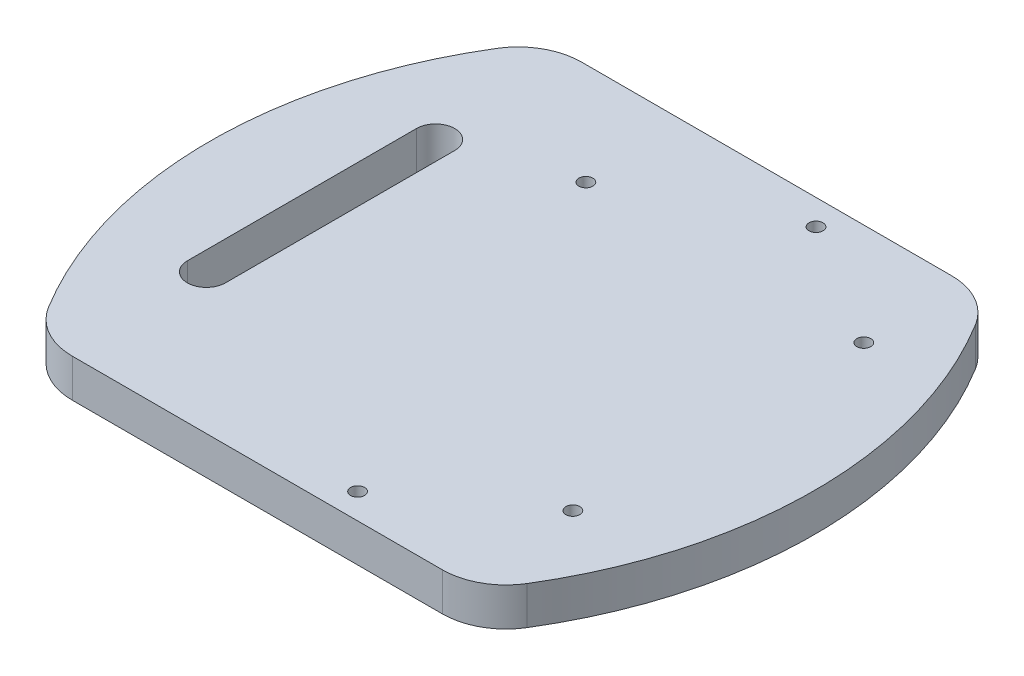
ISO-10303-21;
HEADER;
FILE_DESCRIPTION(('STEP AP214'),'2;1');
FILE_NAME('part.step','',(''),(''),'','','');
FILE_SCHEMA(('AUTOMOTIVE_DESIGN { 1 0 10303 214 1 1 1 1 }'));
ENDSEC;
DATA;
#1=APPLICATION_CONTEXT('core data for automotive mechanical design processes');
#2=APPLICATION_PROTOCOL_DEFINITION('international standard','automotive_design',2000,#1);
#3=PRODUCT_CONTEXT('',#1,'mechanical');
#4=PRODUCT('Part','Part','',(#3));
#5=PRODUCT_RELATED_PRODUCT_CATEGORY('part','',(#4));
#6=PRODUCT_DEFINITION_FORMATION('','',#4);
#7=PRODUCT_DEFINITION_CONTEXT('part definition',#1,'design');
#8=PRODUCT_DEFINITION('design','',#6,#7);
#9=PRODUCT_DEFINITION_SHAPE('','',#8);
#10=(LENGTH_UNIT() NAMED_UNIT(*) SI_UNIT(.MILLI.,.METRE.));
#11=(NAMED_UNIT(*) PLANE_ANGLE_UNIT() SI_UNIT($,.RADIAN.));
#12=(NAMED_UNIT(*) SI_UNIT($,.STERADIAN.) SOLID_ANGLE_UNIT());
#13=UNCERTAINTY_MEASURE_WITH_UNIT(LENGTH_MEASURE(1.E-05),#10,'distance_accuracy_value','');
#14=(GEOMETRIC_REPRESENTATION_CONTEXT(3) GLOBAL_UNCERTAINTY_ASSIGNED_CONTEXT((#13)) GLOBAL_UNIT_ASSIGNED_CONTEXT((#10,
#11,#12)) REPRESENTATION_CONTEXT('',''));
#15=CARTESIAN_POINT('',(0.,0.,0.));
#16=DIRECTION('',(0.,0.,1.));
#17=DIRECTION('',(1.,0.,0.));
#18=AXIS2_PLACEMENT_3D('',#15,#16,#17);
#19=CARTESIAN_POINT('',(-34.0535421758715,6.,30.));
#20=DIRECTION('',(0.,1.,0.));
#21=DIRECTION('',(0.,0.,1.));
#22=AXIS2_PLACEMENT_3D('',#19,#20,#21);
#23=PLANE('',#22);
#24=CARTESIAN_POINT('',(26.26,6.,21.6999999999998));
#25=DIRECTION('',(0.,1.,0.));
#26=DIRECTION('',(0.,0.,1.));
#27=AXIS2_PLACEMENT_3D('',#24,#25,#26);
#28=CIRCLE('',#27,1.1);
#29=CARTESIAN_POINT('',(26.26,6.,22.7999999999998));
#30=VERTEX_POINT('',#29);
#31=EDGE_CURVE('E162',#30,#30,#28,.T.);
#32=ORIENTED_EDGE('',*,*,#31,.F.);
#33=EDGE_LOOP('',(#32));
#34=FACE_BOUND('',#33,.T.);
#35=CARTESIAN_POINT('',(6.75,6.,36.));
#36=DIRECTION('',(0.,1.,0.));
#37=DIRECTION('',(0.,0.,-1.));
#38=AXIS2_PLACEMENT_3D('',#35,#36,#37);
#39=CIRCLE('',#38,1.1);
#40=CARTESIAN_POINT('',(6.75,6.,34.9));
#41=VERTEX_POINT('',#40);
#42=EDGE_CURVE('E174',#41,#41,#39,.T.);
#43=ORIENTED_EDGE('',*,*,#42,.F.);
#44=EDGE_LOOP('',(#43));
#45=FACE_BOUND('',#44,.T.);
#46=CARTESIAN_POINT('',(6.75,6.,-36.));
#47=DIRECTION('',(0.,1.,0.));
#48=DIRECTION('',(0.,0.,1.));
#49=AXIS2_PLACEMENT_3D('',#46,#47,#48);
#50=CIRCLE('',#49,1.1);
#51=CARTESIAN_POINT('',(6.75,6.,-34.9));
#52=VERTEX_POINT('',#51);
#53=EDGE_CURVE('E186',#52,#52,#50,.T.);
#54=ORIENTED_EDGE('',*,*,#53,.F.);
#55=EDGE_LOOP('',(#54));
#56=FACE_BOUND('',#55,.T.);
#57=CARTESIAN_POINT('',(-34.0535421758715,6.,30.));
#58=DIRECTION('',(0.,1.,0.));
#59=DIRECTION('',(0.,0.,1.));
#60=AXIS2_PLACEMENT_3D('',#57,#58,#59);
#61=CIRCLE('',#60,10.);
#62=CARTESIAN_POINT('',(-42.5845929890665,6.,35.2173913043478));
#63=VERTEX_POINT('',#62);
#64=CARTESIAN_POINT('',(-34.0535421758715,6.,40.));
#65=VERTEX_POINT('',#64);
#66=EDGE_CURVE('E192',#63,#65,#61,.T.);
#67=ORIENTED_EDGE('',*,*,#66,.T.);
#68=DIRECTION('',(1.,0.,0.));
#69=VECTOR('',#68,1.);
#70=CARTESIAN_POINT('',(-34.0535421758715,6.,40.));
#71=LINE('',#70,#69);
#72=CARTESIAN_POINT('',(24.0535421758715,6.,40.0000000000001));
#73=VERTEX_POINT('',#72);
#74=EDGE_CURVE('E195',#65,#73,#71,.T.);
#75=ORIENTED_EDGE('',*,*,#74,.T.);
#76=CARTESIAN_POINT('',(24.0535421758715,6.,30.0000000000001));
#77=DIRECTION('',(0.,1.,0.));
#78=DIRECTION('',(0.,0.,-1.));
#79=AXIS2_PLACEMENT_3D('',#76,#77,#78);
#80=CIRCLE('',#79,10.);
#81=CARTESIAN_POINT('',(32.5845929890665,6.,35.2173913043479));
#82=VERTEX_POINT('',#81);
#83=EDGE_CURVE('E198',#73,#82,#80,.T.);
#84=ORIENTED_EDGE('',*,*,#83,.T.);
#85=CARTESIAN_POINT('',(-25.,6.,0.));
#86=DIRECTION('',(0.,1.,0.));
#87=DIRECTION('',(0.,0.,1.));
#88=AXIS2_PLACEMENT_3D('',#85,#86,#87);
#89=CIRCLE('',#88,67.5);
#90=CARTESIAN_POINT('',(32.5845929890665,6.,-35.2173913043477));
#91=VERTEX_POINT('',#90);
#92=EDGE_CURVE('E200',#82,#91,#89,.T.);
#93=ORIENTED_EDGE('',*,*,#92,.T.);
#94=CARTESIAN_POINT('',(24.0535421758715,6.,-29.9999999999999));
#95=DIRECTION('',(0.,1.,0.));
#96=DIRECTION('',(0.,0.,-1.));
#97=AXIS2_PLACEMENT_3D('',#94,#95,#96);
#98=CIRCLE('',#97,10.);
#99=CARTESIAN_POINT('',(24.0535421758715,6.,-39.9999999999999));
#100=VERTEX_POINT('',#99);
#101=EDGE_CURVE('E202',#91,#100,#98,.T.);
#102=ORIENTED_EDGE('',*,*,#101,.T.);
#103=DIRECTION('',(-1.,0.,0.));
#104=VECTOR('',#103,1.);
#105=CARTESIAN_POINT('',(-34.0535421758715,6.,-40.));
#106=LINE('',#105,#104);
#107=CARTESIAN_POINT('',(-34.0535421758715,6.,-40.));
#108=VERTEX_POINT('',#107);
#109=EDGE_CURVE('E204',#100,#108,#106,.T.);
#110=ORIENTED_EDGE('',*,*,#109,.T.);
#111=CARTESIAN_POINT('',(-34.0535421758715,6.,-30.));
#112=DIRECTION('',(0.,1.,0.));
#113=DIRECTION('',(0.,0.,1.));
#114=AXIS2_PLACEMENT_3D('',#111,#112,#113);
#115=CIRCLE('',#114,10.);
#116=CARTESIAN_POINT('',(-42.5845929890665,6.,-35.2173913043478));
#117=VERTEX_POINT('',#116);
#118=EDGE_CURVE('E206',#108,#117,#115,.T.);
#119=ORIENTED_EDGE('',*,*,#118,.T.);
#120=CARTESIAN_POINT('',(15.,6.,0.));
#121=DIRECTION('',(0.,1.,0.));
#122=DIRECTION('',(0.,0.,-1.));
#123=AXIS2_PLACEMENT_3D('',#120,#121,#122);
#124=CIRCLE('',#123,67.5);
#125=EDGE_CURVE('E208',#117,#63,#124,.T.);
#126=ORIENTED_EDGE('',*,*,#125,.T.);
#127=EDGE_LOOP('',(#67,#75,#84,#93,#102,#110,#119,#126));
#128=FACE_BOUND('',#127,.T.);
#129=CARTESIAN_POINT('',(26.26,6.,-24.0000000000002));
#130=DIRECTION('',(0.,1.,0.));
#131=DIRECTION('',(0.,0.,1.));
#132=AXIS2_PLACEMENT_3D('',#129,#130,#131);
#133=CIRCLE('',#132,1.1);
#134=CARTESIAN_POINT('',(26.26,6.,-22.9000000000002));
#135=VERTEX_POINT('',#134);
#136=EDGE_CURVE('E180',#135,#135,#133,.T.);
#137=ORIENTED_EDGE('',*,*,#136,.F.);
#138=EDGE_LOOP('',(#137));
#139=FACE_BOUND('',#138,.T.);
#140=CARTESIAN_POINT('',(-17.4,6.,-24.0000000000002));
#141=DIRECTION('',(0.,1.,0.));
#142=DIRECTION('',(0.,0.,1.));
#143=AXIS2_PLACEMENT_3D('',#140,#141,#142);
#144=CIRCLE('',#143,1.1);
#145=CARTESIAN_POINT('',(-17.4,6.,-22.9000000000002));
#146=VERTEX_POINT('',#145);
#147=EDGE_CURVE('E168',#146,#146,#144,.T.);
#148=ORIENTED_EDGE('',*,*,#147,.F.);
#149=EDGE_LOOP('',(#148));
#150=FACE_BOUND('',#149,.T.);
#151=DIRECTION('',(0.,0.,1.));
#152=VECTOR('',#151,1.);
#153=CARTESIAN_POINT('',(-38.,6.,-18.));
#154=LINE('',#153,#152);
#155=CARTESIAN_POINT('',(-38.,6.,-18.));
#156=VERTEX_POINT('',#155);
#157=CARTESIAN_POINT('',(-38.,6.,18.));
#158=VERTEX_POINT('',#157);
#159=EDGE_CURVE('E134',#156,#158,#154,.T.);
#160=ORIENTED_EDGE('',*,*,#159,.F.);
#161=CARTESIAN_POINT('',(-35.,6.,-18.));
#162=DIRECTION('',(0.,1.,0.));
#163=DIRECTION('',(0.,0.,1.));
#164=AXIS2_PLACEMENT_3D('',#161,#162,#163);
#165=CIRCLE('',#164,3.);
#166=CARTESIAN_POINT('',(-32.,6.,-18.));
#167=VERTEX_POINT('',#166);
#168=EDGE_CURVE('E126',#167,#156,#165,.T.);
#169=ORIENTED_EDGE('',*,*,#168,.F.);
#170=DIRECTION('',(0.,0.,-1.));
#171=VECTOR('',#170,1.);
#172=CARTESIAN_POINT('',(-32.,6.,-18.));
#173=LINE('',#172,#171);
#174=CARTESIAN_POINT('',(-32.,6.,18.));
#175=VERTEX_POINT('',#174);
#176=EDGE_CURVE('E148',#175,#167,#173,.T.);
#177=ORIENTED_EDGE('',*,*,#176,.F.);
#178=CARTESIAN_POINT('',(-35.,6.,18.));
#179=DIRECTION('',(0.,1.,0.));
#180=DIRECTION('',(0.,0.,-1.));
#181=AXIS2_PLACEMENT_3D('',#178,#179,#180);
#182=CIRCLE('',#181,3.);
#183=EDGE_CURVE('E146',#158,#175,#182,.T.);
#184=ORIENTED_EDGE('',*,*,#183,.F.);
#185=EDGE_LOOP('',(#160,#169,#177,#184));
#186=FACE_BOUND('',#185,.T.);
#187=ADVANCED_FACE('F37',(#34,#45,#56,#128,#139,#150,#186),#23,.T.);
#188=CARTESIAN_POINT('',(-34.0535421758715,0.,30.));
#189=DIRECTION('',(0.,1.,0.));
#190=DIRECTION('',(0.,0.,1.));
#191=AXIS2_PLACEMENT_3D('',#188,#189,#190);
#192=PLANE('',#191);
#193=CARTESIAN_POINT('',(26.26,0.,21.6999999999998));
#194=DIRECTION('',(0.,1.,0.));
#195=DIRECTION('',(0.,0.,1.));
#196=AXIS2_PLACEMENT_3D('',#193,#194,#195);
#197=CIRCLE('',#196,1.1);
#198=CARTESIAN_POINT('',(26.26,0.,22.7999999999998));
#199=VERTEX_POINT('',#198);
#200=EDGE_CURVE('E142',#199,#199,#197,.T.);
#201=ORIENTED_EDGE('',*,*,#200,.T.);
#202=EDGE_LOOP('',(#201));
#203=FACE_BOUND('',#202,.T.);
#204=CARTESIAN_POINT('',(6.75,0.,36.));
#205=DIRECTION('',(0.,1.,0.));
#206=DIRECTION('',(0.,0.,-1.));
#207=AXIS2_PLACEMENT_3D('',#204,#205,#206);
#208=CIRCLE('',#207,1.1);
#209=CARTESIAN_POINT('',(6.75,0.,34.9));
#210=VERTEX_POINT('',#209);
#211=EDGE_CURVE('E171',#210,#210,#208,.T.);
#212=ORIENTED_EDGE('',*,*,#211,.T.);
#213=EDGE_LOOP('',(#212));
#214=FACE_BOUND('',#213,.T.);
#215=CARTESIAN_POINT('',(6.75,0.,-36.));
#216=DIRECTION('',(0.,1.,0.));
#217=DIRECTION('',(0.,0.,1.));
#218=AXIS2_PLACEMENT_3D('',#215,#216,#217);
#219=CIRCLE('',#218,1.1);
#220=CARTESIAN_POINT('',(6.75,0.,-34.9));
#221=VERTEX_POINT('',#220);
#222=EDGE_CURVE('E183',#221,#221,#219,.T.);
#223=ORIENTED_EDGE('',*,*,#222,.T.);
#224=EDGE_LOOP('',(#223));
#225=FACE_BOUND('',#224,.T.);
#226=CARTESIAN_POINT('',(-34.0535421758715,0.,30.));
#227=DIRECTION('',(0.,1.,0.));
#228=DIRECTION('',(0.,0.,1.));
#229=AXIS2_PLACEMENT_3D('',#226,#227,#228);
#230=CIRCLE('',#229,10.);
#231=CARTESIAN_POINT('',(-42.5845929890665,0.,35.2173913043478));
#232=VERTEX_POINT('',#231);
#233=CARTESIAN_POINT('',(-34.0535421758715,0.,40.));
#234=VERTEX_POINT('',#233);
#235=EDGE_CURVE('E189',#232,#234,#230,.T.);
#236=ORIENTED_EDGE('',*,*,#235,.F.);
#237=CARTESIAN_POINT('',(15.,0.,0.));
#238=DIRECTION('',(0.,1.,0.));
#239=DIRECTION('',(0.,0.,-1.));
#240=AXIS2_PLACEMENT_3D('',#237,#238,#239);
#241=CIRCLE('',#240,67.5);
#242=CARTESIAN_POINT('',(-42.5845929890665,0.,-35.2173913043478));
#243=VERTEX_POINT('',#242);
#244=EDGE_CURVE('E196',#243,#232,#241,.T.);
#245=ORIENTED_EDGE('',*,*,#244,.F.);
#246=CARTESIAN_POINT('',(-34.0535421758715,0.,-30.));
#247=DIRECTION('',(0.,1.,0.));
#248=DIRECTION('',(0.,0.,1.));
#249=AXIS2_PLACEMENT_3D('',#246,#247,#248);
#250=CIRCLE('',#249,10.);
#251=CARTESIAN_POINT('',(-34.0535421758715,0.,-40.));
#252=VERTEX_POINT('',#251);
#253=EDGE_CURVE('E223',#252,#243,#250,.T.);
#254=ORIENTED_EDGE('',*,*,#253,.F.);
#255=DIRECTION('',(-1.,0.,0.));
#256=VECTOR('',#255,1.);
#257=CARTESIAN_POINT('',(-34.0535421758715,0.,-40.));
#258=LINE('',#257,#256);
#259=CARTESIAN_POINT('',(24.0535421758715,0.,-39.9999999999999));
#260=VERTEX_POINT('',#259);
#261=EDGE_CURVE('E221',#260,#252,#258,.T.);
#262=ORIENTED_EDGE('',*,*,#261,.F.);
#263=CARTESIAN_POINT('',(24.0535421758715,0.,-29.9999999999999));
#264=DIRECTION('',(0.,1.,0.));
#265=DIRECTION('',(0.,0.,-1.));
#266=AXIS2_PLACEMENT_3D('',#263,#264,#265);
#267=CIRCLE('',#266,10.);
#268=CARTESIAN_POINT('',(32.5845929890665,0.,-35.2173913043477));
#269=VERTEX_POINT('',#268);
#270=EDGE_CURVE('E219',#269,#260,#267,.T.);
#271=ORIENTED_EDGE('',*,*,#270,.F.);
#272=CARTESIAN_POINT('',(-25.,0.,0.));
#273=DIRECTION('',(0.,1.,0.));
#274=DIRECTION('',(0.,0.,1.));
#275=AXIS2_PLACEMENT_3D('',#272,#273,#274);
#276=CIRCLE('',#275,67.5);
#277=CARTESIAN_POINT('',(32.5845929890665,0.,35.2173913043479));
#278=VERTEX_POINT('',#277);
#279=EDGE_CURVE('E217',#278,#269,#276,.T.);
#280=ORIENTED_EDGE('',*,*,#279,.F.);
#281=CARTESIAN_POINT('',(24.0535421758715,0.,30.0000000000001));
#282=DIRECTION('',(0.,1.,0.));
#283=DIRECTION('',(0.,0.,-1.));
#284=AXIS2_PLACEMENT_3D('',#281,#282,#283);
#285=CIRCLE('',#284,10.);
#286=CARTESIAN_POINT('',(24.0535421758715,0.,40.0000000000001));
#287=VERTEX_POINT('',#286);
#288=EDGE_CURVE('E215',#287,#278,#285,.T.);
#289=ORIENTED_EDGE('',*,*,#288,.F.);
#290=DIRECTION('',(1.,0.,0.));
#291=VECTOR('',#290,1.);
#292=CARTESIAN_POINT('',(-34.0535421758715,0.,40.));
#293=LINE('',#292,#291);
#294=EDGE_CURVE('E213',#234,#287,#293,.T.);
#295=ORIENTED_EDGE('',*,*,#294,.F.);
#296=EDGE_LOOP('',(#236,#245,#254,#262,#271,#280,#289,#295));
#297=FACE_BOUND('',#296,.T.);
#298=CARTESIAN_POINT('',(26.26,0.,-24.0000000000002));
#299=DIRECTION('',(0.,1.,0.));
#300=DIRECTION('',(0.,0.,1.));
#301=AXIS2_PLACEMENT_3D('',#298,#299,#300);
#302=CIRCLE('',#301,1.1);
#303=CARTESIAN_POINT('',(26.26,0.,-22.9000000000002));
#304=VERTEX_POINT('',#303);
#305=EDGE_CURVE('E177',#304,#304,#302,.T.);
#306=ORIENTED_EDGE('',*,*,#305,.T.);
#307=EDGE_LOOP('',(#306));
#308=FACE_BOUND('',#307,.T.);
#309=CARTESIAN_POINT('',(-17.4,0.,-24.0000000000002));
#310=DIRECTION('',(0.,1.,0.));
#311=DIRECTION('',(0.,0.,1.));
#312=AXIS2_PLACEMENT_3D('',#309,#310,#311);
#313=CIRCLE('',#312,1.1);
#314=CARTESIAN_POINT('',(-17.4,0.,-22.9000000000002));
#315=VERTEX_POINT('',#314);
#316=EDGE_CURVE('E165',#315,#315,#313,.T.);
#317=ORIENTED_EDGE('',*,*,#316,.T.);
#318=EDGE_LOOP('',(#317));
#319=FACE_BOUND('',#318,.T.);
#320=CARTESIAN_POINT('',(-35.,0.,-18.));
#321=DIRECTION('',(0.,1.,0.));
#322=DIRECTION('',(0.,0.,1.));
#323=AXIS2_PLACEMENT_3D('',#320,#321,#322);
#324=CIRCLE('',#323,3.);
#325=CARTESIAN_POINT('',(-32.,0.,-18.));
#326=VERTEX_POINT('',#325);
#327=CARTESIAN_POINT('',(-38.,0.,-18.));
#328=VERTEX_POINT('',#327);
#329=EDGE_CURVE('E60',#326,#328,#324,.T.);
#330=ORIENTED_EDGE('',*,*,#329,.T.);
#331=DIRECTION('',(0.,0.,1.));
#332=VECTOR('',#331,1.);
#333=CARTESIAN_POINT('',(-38.,0.,-18.));
#334=LINE('',#333,#332);
#335=CARTESIAN_POINT('',(-38.,0.,18.));
#336=VERTEX_POINT('',#335);
#337=EDGE_CURVE('E141',#328,#336,#334,.T.);
#338=ORIENTED_EDGE('',*,*,#337,.T.);
#339=CARTESIAN_POINT('',(-35.,0.,18.));
#340=DIRECTION('',(0.,1.,0.));
#341=DIRECTION('',(0.,0.,-1.));
#342=AXIS2_PLACEMENT_3D('',#339,#340,#341);
#343=CIRCLE('',#342,3.);
#344=CARTESIAN_POINT('',(-32.,0.,18.));
#345=VERTEX_POINT('',#344);
#346=EDGE_CURVE('E154',#336,#345,#343,.T.);
#347=ORIENTED_EDGE('',*,*,#346,.T.);
#348=DIRECTION('',(0.,0.,-1.));
#349=VECTOR('',#348,1.);
#350=CARTESIAN_POINT('',(-32.,0.,-18.));
#351=LINE('',#350,#349);
#352=EDGE_CURVE('E135',#345,#326,#351,.T.);
#353=ORIENTED_EDGE('',*,*,#352,.T.);
#354=EDGE_LOOP('',(#330,#338,#347,#353));
#355=FACE_BOUND('',#354,.T.);
#356=ADVANCED_FACE('F253',(#203,#214,#225,#297,#308,#319,#355),#192,.F.);
#357=CARTESIAN_POINT('',(-34.0535421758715,6.,30.));
#358=DIRECTION('',(0.,-1.,0.));
#359=DIRECTION('',(0.,0.,-1.));
#360=AXIS2_PLACEMENT_3D('',#357,#358,#359);
#361=CYLINDRICAL_SURFACE('',#360,10.);
#362=ORIENTED_EDGE('',*,*,#235,.T.);
#363=DIRECTION('',(0.,-1.,0.));
#364=VECTOR('',#363,1.);
#365=CARTESIAN_POINT('',(-34.0535421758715,6.,40.));
#366=LINE('',#365,#364);
#367=EDGE_CURVE('E11',#65,#234,#366,.T.);
#368=ORIENTED_EDGE('',*,*,#367,.F.);
#369=ORIENTED_EDGE('',*,*,#66,.F.);
#370=DIRECTION('',(0.,-1.,0.));
#371=VECTOR('',#370,1.);
#372=CARTESIAN_POINT('',(-42.5845929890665,6.,35.2173913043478));
#373=LINE('',#372,#371);
#374=EDGE_CURVE('E210',#63,#232,#373,.T.);
#375=ORIENTED_EDGE('',*,*,#374,.T.);
#376=EDGE_LOOP('',(#362,#368,#369,#375));
#377=FACE_BOUND('',#376,.T.);
#378=ADVANCED_FACE('F39',(#377),#361,.T.);
#379=CARTESIAN_POINT('',(-34.0535421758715,6.,40.));
#380=DIRECTION('',(0.,0.,-1.));
#381=DIRECTION('',(-1.,0.,0.));
#382=AXIS2_PLACEMENT_3D('',#379,#380,#381);
#383=PLANE('',#382);
#384=ORIENTED_EDGE('',*,*,#294,.T.);
#385=DIRECTION('',(0.,-1.,0.));
#386=VECTOR('',#385,1.);
#387=CARTESIAN_POINT('',(24.0535421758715,6.,40.0000000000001));
#388=LINE('',#387,#386);
#389=EDGE_CURVE('E45',#73,#287,#388,.T.);
#390=ORIENTED_EDGE('',*,*,#389,.F.);
#391=ORIENTED_EDGE('',*,*,#74,.F.);
#392=ORIENTED_EDGE('',*,*,#367,.T.);
#393=EDGE_LOOP('',(#384,#390,#391,#392));
#394=FACE_BOUND('',#393,.T.);
#395=ADVANCED_FACE('F271',(#394),#383,.F.);
#396=CARTESIAN_POINT('',(24.0535421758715,6.,30.0000000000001));
#397=DIRECTION('',(0.,-1.,0.));
#398=DIRECTION('',(0.,0.,-1.));
#399=AXIS2_PLACEMENT_3D('',#396,#397,#398);
#400=CYLINDRICAL_SURFACE('',#399,10.);
#401=ORIENTED_EDGE('',*,*,#288,.T.);
#402=DIRECTION('',(0.,-1.,0.));
#403=VECTOR('',#402,1.);
#404=CARTESIAN_POINT('',(32.5845929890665,6.,35.2173913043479));
#405=LINE('',#404,#403);
#406=EDGE_CURVE('E240',#82,#278,#405,.T.);
#407=ORIENTED_EDGE('',*,*,#406,.F.);
#408=ORIENTED_EDGE('',*,*,#83,.F.);
#409=ORIENTED_EDGE('',*,*,#389,.T.);
#410=EDGE_LOOP('',(#401,#407,#408,#409));
#411=FACE_BOUND('',#410,.T.);
#412=ADVANCED_FACE('F247',(#411),#400,.T.);
#413=CARTESIAN_POINT('',(-25.,6.,0.));
#414=DIRECTION('',(0.,-1.,0.));
#415=DIRECTION('',(0.,0.,-1.));
#416=AXIS2_PLACEMENT_3D('',#413,#414,#415);
#417=CYLINDRICAL_SURFACE('',#416,67.5);
#418=ORIENTED_EDGE('',*,*,#279,.T.);
#419=DIRECTION('',(0.,-1.,0.));
#420=VECTOR('',#419,1.);
#421=CARTESIAN_POINT('',(32.5845929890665,6.,-35.2173913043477));
#422=LINE('',#421,#420);
#423=EDGE_CURVE('E237',#91,#269,#422,.T.);
#424=ORIENTED_EDGE('',*,*,#423,.F.);
#425=ORIENTED_EDGE('',*,*,#92,.F.);
#426=ORIENTED_EDGE('',*,*,#406,.T.);
#427=EDGE_LOOP('',(#418,#424,#425,#426));
#428=FACE_BOUND('',#427,.T.);
#429=ADVANCED_FACE('F259',(#428),#417,.T.);
#430=CARTESIAN_POINT('',(24.0535421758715,6.,-29.9999999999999));
#431=DIRECTION('',(0.,-1.,0.));
#432=DIRECTION('',(0.,0.,-1.));
#433=AXIS2_PLACEMENT_3D('',#430,#431,#432);
#434=CYLINDRICAL_SURFACE('',#433,10.);
#435=ORIENTED_EDGE('',*,*,#270,.T.);
#436=DIRECTION('',(0.,-1.,0.));
#437=VECTOR('',#436,1.);
#438=CARTESIAN_POINT('',(24.0535421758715,6.,-39.9999999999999));
#439=LINE('',#438,#437);
#440=EDGE_CURVE('E234',#100,#260,#439,.T.);
#441=ORIENTED_EDGE('',*,*,#440,.F.);
#442=ORIENTED_EDGE('',*,*,#101,.F.);
#443=ORIENTED_EDGE('',*,*,#423,.T.);
#444=EDGE_LOOP('',(#435,#441,#442,#443));
#445=FACE_BOUND('',#444,.T.);
#446=ADVANCED_FACE('F263',(#445),#434,.T.);
#447=CARTESIAN_POINT('',(-34.0535421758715,6.,-40.));
#448=DIRECTION('',(0.,0.,1.));
#449=DIRECTION('',(1.,0.,0.));
#450=AXIS2_PLACEMENT_3D('',#447,#448,#449);
#451=PLANE('',#450);
#452=ORIENTED_EDGE('',*,*,#261,.T.);
#453=DIRECTION('',(0.,-1.,0.));
#454=VECTOR('',#453,1.);
#455=CARTESIAN_POINT('',(-34.0535421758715,6.,-40.));
#456=LINE('',#455,#454);
#457=EDGE_CURVE('E231',#108,#252,#456,.T.);
#458=ORIENTED_EDGE('',*,*,#457,.F.);
#459=ORIENTED_EDGE('',*,*,#109,.F.);
#460=ORIENTED_EDGE('',*,*,#440,.T.);
#461=EDGE_LOOP('',(#452,#458,#459,#460));
#462=FACE_BOUND('',#461,.T.);
#463=ADVANCED_FACE('F284',(#462),#451,.F.);
#464=CARTESIAN_POINT('',(-34.0535421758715,6.,-30.));
#465=DIRECTION('',(0.,-1.,0.));
#466=DIRECTION('',(0.,0.,-1.));
#467=AXIS2_PLACEMENT_3D('',#464,#465,#466);
#468=CYLINDRICAL_SURFACE('',#467,10.);
#469=ORIENTED_EDGE('',*,*,#253,.T.);
#470=DIRECTION('',(0.,-1.,0.));
#471=VECTOR('',#470,1.);
#472=CARTESIAN_POINT('',(-42.5845929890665,6.,-35.2173913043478));
#473=LINE('',#472,#471);
#474=EDGE_CURVE('E228',#117,#243,#473,.T.);
#475=ORIENTED_EDGE('',*,*,#474,.F.);
#476=ORIENTED_EDGE('',*,*,#118,.F.);
#477=ORIENTED_EDGE('',*,*,#457,.T.);
#478=EDGE_LOOP('',(#469,#475,#476,#477));
#479=FACE_BOUND('',#478,.T.);
#480=ADVANCED_FACE('F282',(#479),#468,.T.);
#481=CARTESIAN_POINT('',(15.,6.,0.));
#482=DIRECTION('',(0.,-1.,0.));
#483=DIRECTION('',(0.,0.,-1.));
#484=AXIS2_PLACEMENT_3D('',#481,#482,#483);
#485=CYLINDRICAL_SURFACE('',#484,67.5);
#486=ORIENTED_EDGE('',*,*,#244,.T.);
#487=ORIENTED_EDGE('',*,*,#374,.F.);
#488=ORIENTED_EDGE('',*,*,#125,.F.);
#489=ORIENTED_EDGE('',*,*,#474,.T.);
#490=EDGE_LOOP('',(#486,#487,#488,#489));
#491=FACE_BOUND('',#490,.T.);
#492=ADVANCED_FACE('F277',(#491),#485,.T.);
#493=CARTESIAN_POINT('',(6.75,6.,-36.));
#494=DIRECTION('',(0.,-1.,0.));
#495=DIRECTION('',(0.,0.,-1.));
#496=AXIS2_PLACEMENT_3D('',#493,#494,#495);
#497=CYLINDRICAL_SURFACE('',#496,1.1);
#498=ORIENTED_EDGE('',*,*,#53,.T.);
#499=EDGE_LOOP('',(#498));
#500=FACE_BOUND('',#499,.T.);
#501=ORIENTED_EDGE('',*,*,#222,.F.);
#502=EDGE_LOOP('',(#501));
#503=FACE_BOUND('',#502,.T.);
#504=ADVANCED_FACE('F304',(#500,#503),#497,.F.);
#505=CARTESIAN_POINT('',(26.26,6.,-24.0000000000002));
#506=DIRECTION('',(0.,-1.,0.));
#507=DIRECTION('',(0.,0.,-1.));
#508=AXIS2_PLACEMENT_3D('',#505,#506,#507);
#509=CYLINDRICAL_SURFACE('',#508,1.1);
#510=ORIENTED_EDGE('',*,*,#136,.T.);
#511=EDGE_LOOP('',(#510));
#512=FACE_BOUND('',#511,.T.);
#513=ORIENTED_EDGE('',*,*,#305,.F.);
#514=EDGE_LOOP('',(#513));
#515=FACE_BOUND('',#514,.T.);
#516=ADVANCED_FACE('F311',(#512,#515),#509,.F.);
#517=CARTESIAN_POINT('',(6.75,6.,36.));
#518=DIRECTION('',(0.,-1.,0.));
#519=DIRECTION('',(0.,0.,-1.));
#520=AXIS2_PLACEMENT_3D('',#517,#518,#519);
#521=CYLINDRICAL_SURFACE('',#520,1.1);
#522=ORIENTED_EDGE('',*,*,#42,.T.);
#523=EDGE_LOOP('',(#522));
#524=FACE_BOUND('',#523,.T.);
#525=ORIENTED_EDGE('',*,*,#211,.F.);
#526=EDGE_LOOP('',(#525));
#527=FACE_BOUND('',#526,.T.);
#528=ADVANCED_FACE('F316',(#524,#527),#521,.F.);
#529=CARTESIAN_POINT('',(-17.4,6.,-24.0000000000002));
#530=DIRECTION('',(0.,-1.,0.));
#531=DIRECTION('',(0.,0.,-1.));
#532=AXIS2_PLACEMENT_3D('',#529,#530,#531);
#533=CYLINDRICAL_SURFACE('',#532,1.1);
#534=ORIENTED_EDGE('',*,*,#147,.T.);
#535=EDGE_LOOP('',(#534));
#536=FACE_BOUND('',#535,.T.);
#537=ORIENTED_EDGE('',*,*,#316,.F.);
#538=EDGE_LOOP('',(#537));
#539=FACE_BOUND('',#538,.T.);
#540=ADVANCED_FACE('F326',(#536,#539),#533,.F.);
#541=CARTESIAN_POINT('',(26.26,6.,21.6999999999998));
#542=DIRECTION('',(0.,-1.,0.));
#543=DIRECTION('',(0.,0.,-1.));
#544=AXIS2_PLACEMENT_3D('',#541,#542,#543);
#545=CYLINDRICAL_SURFACE('',#544,1.1);
#546=ORIENTED_EDGE('',*,*,#31,.T.);
#547=EDGE_LOOP('',(#546));
#548=FACE_BOUND('',#547,.T.);
#549=ORIENTED_EDGE('',*,*,#200,.F.);
#550=EDGE_LOOP('',(#549));
#551=FACE_BOUND('',#550,.T.);
#552=ADVANCED_FACE('F333',(#548,#551),#545,.F.);
#553=CARTESIAN_POINT('',(-35.,6.,-18.));
#554=DIRECTION('',(0.,-1.,0.));
#555=DIRECTION('',(0.,0.,-1.));
#556=AXIS2_PLACEMENT_3D('',#553,#554,#555);
#557=CYLINDRICAL_SURFACE('',#556,3.);
#558=ORIENTED_EDGE('',*,*,#329,.F.);
#559=DIRECTION('',(0.,-1.,0.));
#560=VECTOR('',#559,1.);
#561=CARTESIAN_POINT('',(-32.,6.,-18.));
#562=LINE('',#561,#560);
#563=EDGE_CURVE('E130',#167,#326,#562,.T.);
#564=ORIENTED_EDGE('',*,*,#563,.F.);
#565=ORIENTED_EDGE('',*,*,#168,.T.);
#566=DIRECTION('',(0.,-1.,0.));
#567=VECTOR('',#566,1.);
#568=CARTESIAN_POINT('',(-38.,6.,-18.));
#569=LINE('',#568,#567);
#570=EDGE_CURVE('E129',#156,#328,#569,.T.);
#571=ORIENTED_EDGE('',*,*,#570,.T.);
#572=EDGE_LOOP('',(#558,#564,#565,#571));
#573=FACE_BOUND('',#572,.T.);
#574=ADVANCED_FACE('F128',(#573),#557,.F.);
#575=CARTESIAN_POINT('',(-38.,6.,-18.));
#576=DIRECTION('',(1.,0.,0.));
#577=DIRECTION('',(0.,0.,-1.));
#578=AXIS2_PLACEMENT_3D('',#575,#576,#577);
#579=PLANE('',#578);
#580=ORIENTED_EDGE('',*,*,#337,.F.);
#581=ORIENTED_EDGE('',*,*,#570,.F.);
#582=ORIENTED_EDGE('',*,*,#159,.T.);
#583=DIRECTION('',(0.,-1.,0.));
#584=VECTOR('',#583,1.);
#585=CARTESIAN_POINT('',(-38.,6.,18.));
#586=LINE('',#585,#584);
#587=EDGE_CURVE('E143',#158,#336,#586,.T.);
#588=ORIENTED_EDGE('',*,*,#587,.T.);
#589=EDGE_LOOP('',(#580,#581,#582,#588));
#590=FACE_BOUND('',#589,.T.);
#591=ADVANCED_FACE('F138',(#590),#579,.T.);
#592=CARTESIAN_POINT('',(-35.,6.,18.));
#593=DIRECTION('',(0.,-1.,0.));
#594=DIRECTION('',(0.,0.,-1.));
#595=AXIS2_PLACEMENT_3D('',#592,#593,#594);
#596=CYLINDRICAL_SURFACE('',#595,3.);
#597=ORIENTED_EDGE('',*,*,#346,.F.);
#598=ORIENTED_EDGE('',*,*,#587,.F.);
#599=ORIENTED_EDGE('',*,*,#183,.T.);
#600=DIRECTION('',(0.,-1.,0.));
#601=VECTOR('',#600,1.);
#602=CARTESIAN_POINT('',(-32.,6.,18.));
#603=LINE('',#602,#601);
#604=EDGE_CURVE('E52',#175,#345,#603,.T.);
#605=ORIENTED_EDGE('',*,*,#604,.T.);
#606=EDGE_LOOP('',(#597,#598,#599,#605));
#607=FACE_BOUND('',#606,.T.);
#608=ADVANCED_FACE('F342',(#607),#596,.F.);
#609=CARTESIAN_POINT('',(-32.,6.,-18.));
#610=DIRECTION('',(-1.,0.,0.));
#611=DIRECTION('',(0.,0.,1.));
#612=AXIS2_PLACEMENT_3D('',#609,#610,#611);
#613=PLANE('',#612);
#614=ORIENTED_EDGE('',*,*,#352,.F.);
#615=ORIENTED_EDGE('',*,*,#604,.F.);
#616=ORIENTED_EDGE('',*,*,#176,.T.);
#617=ORIENTED_EDGE('',*,*,#563,.T.);
#618=EDGE_LOOP('',(#614,#615,#616,#617));
#619=FACE_BOUND('',#618,.T.);
#620=ADVANCED_FACE('F345',(#619),#613,.T.);
#621=CLOSED_SHELL('',(#187,#356,#378,#395,#412,#429,#446,#463,#480,#492,#504,#516,#528,#540,
#552,#574,#591,#608,#620));
#622=MANIFOLD_SOLID_BREP('B2',#621);
#623=ADVANCED_BREP_SHAPE_REPRESENTATION('',(#18,#622),#14);
#624=SHAPE_DEFINITION_REPRESENTATION(#9,#623);
ENDSEC;
END-ISO-10303-21;
